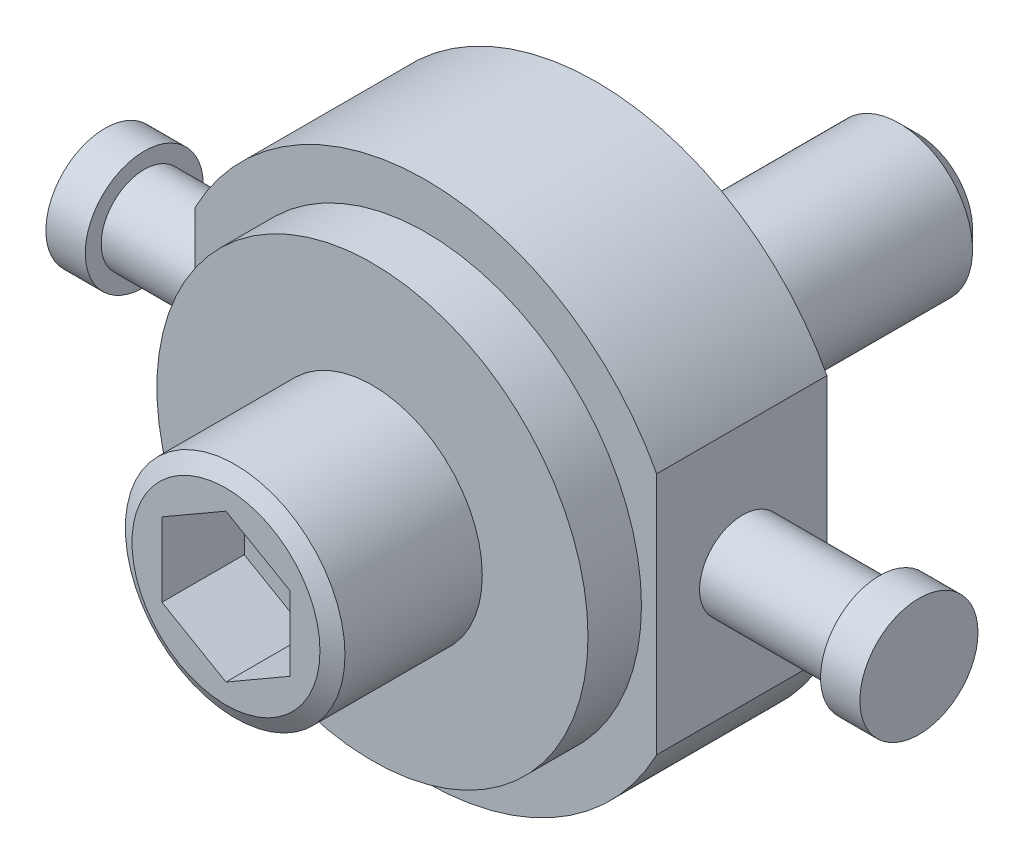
ISO-10303-21;
HEADER;
FILE_DESCRIPTION(('STEP AP214'),'2;1');
FILE_NAME('part.step','',(''),(''),'','','');
FILE_SCHEMA(('AUTOMOTIVE_DESIGN { 1 0 10303 214 1 1 1 1 }'));
ENDSEC;
DATA;
#1=APPLICATION_CONTEXT('core data for automotive mechanical design processes');
#2=APPLICATION_PROTOCOL_DEFINITION('international standard','automotive_design',2000,#1);
#3=PRODUCT_CONTEXT('',#1,'mechanical');
#4=PRODUCT('Part','Part','',(#3));
#5=PRODUCT_RELATED_PRODUCT_CATEGORY('part','',(#4));
#6=PRODUCT_DEFINITION_FORMATION('','',#4);
#7=PRODUCT_DEFINITION_CONTEXT('part definition',#1,'design');
#8=PRODUCT_DEFINITION('design','',#6,#7);
#9=PRODUCT_DEFINITION_SHAPE('','',#8);
#10=(LENGTH_UNIT() NAMED_UNIT(*) SI_UNIT(.MILLI.,.METRE.));
#11=(NAMED_UNIT(*) PLANE_ANGLE_UNIT() SI_UNIT($,.RADIAN.));
#12=(NAMED_UNIT(*) SI_UNIT($,.STERADIAN.) SOLID_ANGLE_UNIT());
#13=UNCERTAINTY_MEASURE_WITH_UNIT(LENGTH_MEASURE(1.E-05),#10,'distance_accuracy_value','');
#14=(GEOMETRIC_REPRESENTATION_CONTEXT(3) GLOBAL_UNCERTAINTY_ASSIGNED_CONTEXT((#13)) GLOBAL_UNIT_ASSIGNED_CONTEXT((#10,
#11,#12)) REPRESENTATION_CONTEXT('',''));
#15=CARTESIAN_POINT('',(0.,0.,0.));
#16=DIRECTION('',(0.,0.,1.));
#17=DIRECTION('',(1.,0.,0.));
#18=AXIS2_PLACEMENT_3D('',#15,#16,#17);
#19=CARTESIAN_POINT('',(0.,0.,0.));
#20=DIRECTION('',(0.,0.,1.));
#21=DIRECTION('',(1.,0.,0.));
#22=AXIS2_PLACEMENT_3D('',#19,#20,#21);
#23=PLANE('',#22);
#24=CARTESIAN_POINT('',(0.,0.,0.));
#25=DIRECTION('',(0.,0.,1.));
#26=DIRECTION('',(1.,0.,0.));
#27=AXIS2_PLACEMENT_3D('',#24,#25,#26);
#28=CIRCLE('',#27,18.9);
#29=CARTESIAN_POINT('',(18.9,0.,0.));
#30=VERTEX_POINT('',#29);
#31=EDGE_CURVE('E208',#30,#30,#28,.T.);
#32=ORIENTED_EDGE('',*,*,#31,.F.);
#33=EDGE_LOOP('',(#32));
#34=FACE_BOUND('',#33,.T.);
#35=CARTESIAN_POINT('',(0.,0.,0.));
#36=DIRECTION('',(0.,0.,-1.));
#37=DIRECTION('',(-1.,0.,0.));
#38=AXIS2_PLACEMENT_3D('',#35,#36,#37);
#39=CIRCLE('',#38,8.);
#40=CARTESIAN_POINT('',(-8.,0.,0.));
#41=VERTEX_POINT('',#40);
#42=EDGE_CURVE('E147',#41,#41,#39,.T.);
#43=ORIENTED_EDGE('',*,*,#42,.F.);
#44=EDGE_LOOP('',(#43));
#45=FACE_BOUND('',#44,.T.);
#46=ADVANCED_FACE('F14',(#34,#45),#23,.F.);
#47=CARTESIAN_POINT('',(40.165,0.,15.32));
#48=DIRECTION('',(1.,0.,0.));
#49=DIRECTION('',(0.,0.,-1.));
#50=AXIS2_PLACEMENT_3D('',#47,#48,#49);
#51=PLANE('',#50);
#52=CARTESIAN_POINT('',(40.165,0.,15.32));
#53=DIRECTION('',(1.,0.,0.));
#54=DIRECTION('',(0.,0.,-1.));
#55=AXIS2_PLACEMENT_3D('',#52,#53,#54);
#56=CIRCLE('',#55,4.71);
#57=CARTESIAN_POINT('',(40.165,0.,10.61));
#58=VERTEX_POINT('',#57);
#59=EDGE_CURVE('E151',#58,#58,#56,.T.);
#60=ORIENTED_EDGE('',*,*,#59,.T.);
#61=EDGE_LOOP('',(#60));
#62=FACE_BOUND('',#61,.T.);
#63=CARTESIAN_POINT('',(40.165,0.,15.32));
#64=DIRECTION('',(1.,0.,0.));
#65=DIRECTION('',(0.,0.,-1.));
#66=AXIS2_PLACEMENT_3D('',#63,#64,#65);
#67=CIRCLE('',#66,6.45);
#68=CARTESIAN_POINT('',(40.165,0.,8.87));
#69=VERTEX_POINT('',#68);
#70=EDGE_CURVE('E157',#69,#69,#67,.T.);
#71=ORIENTED_EDGE('',*,*,#70,.F.);
#72=EDGE_LOOP('',(#71));
#73=FACE_BOUND('',#72,.T.);
#74=ADVANCED_FACE('F238',(#62,#73),#51,.F.);
#75=CARTESIAN_POINT('',(-40.165,0.,15.32));
#76=DIRECTION('',(1.,0.,0.));
#77=DIRECTION('',(0.,0.,-1.));
#78=AXIS2_PLACEMENT_3D('',#75,#76,#77);
#79=PLANE('',#78);
#80=CARTESIAN_POINT('',(-40.165,0.,15.32));
#81=DIRECTION('',(1.,0.,0.));
#82=DIRECTION('',(0.,0.,-1.));
#83=AXIS2_PLACEMENT_3D('',#80,#81,#82);
#84=CIRCLE('',#83,4.71);
#85=CARTESIAN_POINT('',(-40.165,0.,10.61));
#86=VERTEX_POINT('',#85);
#87=EDGE_CURVE('E214',#86,#86,#84,.F.);
#88=ORIENTED_EDGE('',*,*,#87,.T.);
#89=EDGE_LOOP('',(#88));
#90=FACE_BOUND('',#89,.T.);
#91=CARTESIAN_POINT('',(-40.165,0.,15.32));
#92=DIRECTION('',(1.,0.,0.));
#93=DIRECTION('',(0.,0.,-1.));
#94=AXIS2_PLACEMENT_3D('',#91,#92,#93);
#95=CIRCLE('',#94,6.45);
#96=CARTESIAN_POINT('',(-40.165,0.,8.87));
#97=VERTEX_POINT('',#96);
#98=EDGE_CURVE('E139',#97,#97,#95,.T.);
#99=ORIENTED_EDGE('',*,*,#98,.T.);
#100=EDGE_LOOP('',(#99));
#101=FACE_BOUND('',#100,.T.);
#102=ADVANCED_FACE('F244',(#90,#101),#79,.T.);
#103=CARTESIAN_POINT('',(41.21,0.,15.32));
#104=DIRECTION('',(-1.,0.,0.));
#105=DIRECTION('',(0.,0.,1.));
#106=AXIS2_PLACEMENT_3D('',#103,#104,#105);
#107=CYLINDRICAL_SURFACE('',#106,4.71);
#108=CARTESIAN_POINT('',(25.21,0.,15.32));
#109=DIRECTION('',(1.,0.,0.));
#110=DIRECTION('',(0.,0.,-1.));
#111=AXIS2_PLACEMENT_3D('',#108,#109,#110);
#112=CIRCLE('',#111,4.71);
#113=CARTESIAN_POINT('',(25.21,0.,10.61));
#114=VERTEX_POINT('',#113);
#115=EDGE_CURVE('E166',#114,#114,#112,.T.);
#116=ORIENTED_EDGE('',*,*,#115,.T.);
#117=EDGE_LOOP('',(#116));
#118=FACE_BOUND('',#117,.T.);
#119=ORIENTED_EDGE('',*,*,#59,.F.);
#120=EDGE_LOOP('',(#119));
#121=FACE_BOUND('',#120,.T.);
#122=ADVANCED_FACE('F295',(#118,#121),#107,.T.);
#123=CARTESIAN_POINT('',(25.21,13.2930771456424,24.72));
#124=DIRECTION('',(1.,0.,0.));
#125=DIRECTION('',(0.,0.,-1.));
#126=AXIS2_PLACEMENT_3D('',#123,#124,#125);
#127=PLANE('',#126);
#128=DIRECTION('',(0.,0.,-1.));
#129=VECTOR('',#128,1.);
#130=CARTESIAN_POINT('',(25.21,13.2930771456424,24.72));
#131=LINE('',#130,#129);
#132=CARTESIAN_POINT('',(25.21,13.2930771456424,24.72));
#133=VERTEX_POINT('',#132);
#134=CARTESIAN_POINT('',(25.21,13.2930771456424,6.12));
#135=VERTEX_POINT('',#134);
#136=EDGE_CURVE('E204',#133,#135,#131,.T.);
#137=ORIENTED_EDGE('',*,*,#136,.F.);
#138=DIRECTION('',(0.,-1.,0.));
#139=VECTOR('',#138,1.);
#140=CARTESIAN_POINT('',(25.21,13.2930771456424,24.72));
#141=LINE('',#140,#139);
#142=CARTESIAN_POINT('',(25.21,-13.2930771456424,24.72));
#143=VERTEX_POINT('',#142);
#144=EDGE_CURVE('E196',#133,#143,#141,.T.);
#145=ORIENTED_EDGE('',*,*,#144,.T.);
#146=DIRECTION('',(0.,0.,-1.));
#147=VECTOR('',#146,1.);
#148=CARTESIAN_POINT('',(25.21,-13.2930771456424,24.72));
#149=LINE('',#148,#147);
#150=CARTESIAN_POINT('',(25.21,-13.2930771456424,6.12));
#151=VERTEX_POINT('',#150);
#152=EDGE_CURVE('E206',#143,#151,#149,.T.);
#153=ORIENTED_EDGE('',*,*,#152,.T.);
#154=DIRECTION('',(0.,-1.,0.));
#155=VECTOR('',#154,1.);
#156=CARTESIAN_POINT('',(25.21,13.2930771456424,6.12));
#157=LINE('',#156,#155);
#158=EDGE_CURVE('E185',#135,#151,#157,.T.);
#159=ORIENTED_EDGE('',*,*,#158,.F.);
#160=EDGE_LOOP('',(#137,#145,#153,#159));
#161=FACE_BOUND('',#160,.T.);
#162=ORIENTED_EDGE('',*,*,#115,.F.);
#163=EDGE_LOOP('',(#162));
#164=FACE_BOUND('',#163,.T.);
#165=ADVANCED_FACE('F251',(#161,#164),#127,.T.);
#166=CARTESIAN_POINT('',(0.,0.,30.56));
#167=DIRECTION('',(0.,0.,1.));
#168=DIRECTION('',(1.,0.,0.));
#169=AXIS2_PLACEMENT_3D('',#166,#167,#168);
#170=PLANE('',#169);
#171=CARTESIAN_POINT('',(0.,0.,30.56));
#172=DIRECTION('',(0.,0.,1.));
#173=DIRECTION('',(1.,0.,0.));
#174=AXIS2_PLACEMENT_3D('',#171,#172,#173);
#175=CIRCLE('',#174,23.55);
#176=CARTESIAN_POINT('',(23.55,0.,30.56));
#177=VERTEX_POINT('',#176);
#178=EDGE_CURVE('E175',#177,#177,#175,.T.);
#179=ORIENTED_EDGE('',*,*,#178,.T.);
#180=EDGE_LOOP('',(#179));
#181=FACE_BOUND('',#180,.T.);
#182=CARTESIAN_POINT('',(0.,0.,30.56));
#183=DIRECTION('',(0.,0.,1.));
#184=DIRECTION('',(1.,0.,0.));
#185=AXIS2_PLACEMENT_3D('',#182,#183,#184);
#186=CIRCLE('',#185,12.);
#187=CARTESIAN_POINT('',(12.,0.,30.56));
#188=VERTEX_POINT('',#187);
#189=EDGE_CURVE('E169',#188,#188,#186,.T.);
#190=ORIENTED_EDGE('',*,*,#189,.F.);
#191=EDGE_LOOP('',(#190));
#192=FACE_BOUND('',#191,.T.);
#193=ADVANCED_FACE('F283',(#181,#192),#170,.T.);
#194=CARTESIAN_POINT('',(0.,0.,24.72));
#195=DIRECTION('',(0.,0.,1.));
#196=DIRECTION('',(1.,0.,0.));
#197=AXIS2_PLACEMENT_3D('',#194,#195,#196);
#198=PLANE('',#197);
#199=CARTESIAN_POINT('',(0.,0.,24.72));
#200=DIRECTION('',(0.,0.,1.));
#201=DIRECTION('',(1.,0.,0.));
#202=AXIS2_PLACEMENT_3D('',#199,#200,#201);
#203=CIRCLE('',#202,28.5);
#204=CARTESIAN_POINT('',(-25.21,-13.2930771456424,24.72));
#205=VERTEX_POINT('',#204);
#206=EDGE_CURVE('E181',#205,#143,#203,.T.);
#207=ORIENTED_EDGE('',*,*,#206,.T.);
#208=ORIENTED_EDGE('',*,*,#144,.F.);
#209=CARTESIAN_POINT('',(0.,0.,24.72));
#210=DIRECTION('',(0.,0.,1.));
#211=DIRECTION('',(1.,0.,0.));
#212=AXIS2_PLACEMENT_3D('',#209,#210,#211);
#213=CIRCLE('',#212,28.5);
#214=CARTESIAN_POINT('',(-25.21,13.2930771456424,24.72));
#215=VERTEX_POINT('',#214);
#216=EDGE_CURVE('E193',#133,#215,#213,.T.);
#217=ORIENTED_EDGE('',*,*,#216,.T.);
#218=DIRECTION('',(0.,-1.,0.));
#219=VECTOR('',#218,1.);
#220=CARTESIAN_POINT('',(-25.21,13.2930771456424,24.72));
#221=LINE('',#220,#219);
#222=EDGE_CURVE('E190',#215,#205,#221,.T.);
#223=ORIENTED_EDGE('',*,*,#222,.T.);
#224=EDGE_LOOP('',(#207,#208,#217,#223));
#225=FACE_BOUND('',#224,.T.);
#226=CARTESIAN_POINT('',(0.,0.,24.72));
#227=DIRECTION('',(0.,0.,1.));
#228=DIRECTION('',(1.,0.,0.));
#229=AXIS2_PLACEMENT_3D('',#226,#227,#228);
#230=CIRCLE('',#229,23.55);
#231=CARTESIAN_POINT('',(23.55,0.,24.72));
#232=VERTEX_POINT('',#231);
#233=EDGE_CURVE('E172',#232,#232,#230,.T.);
#234=ORIENTED_EDGE('',*,*,#233,.F.);
#235=EDGE_LOOP('',(#234));
#236=FACE_BOUND('',#235,.T.);
#237=ADVANCED_FACE('F285',(#225,#236),#198,.T.);
#238=CARTESIAN_POINT('',(0.,0.,6.12));
#239=DIRECTION('',(0.,0.,1.));
#240=DIRECTION('',(1.,0.,0.));
#241=AXIS2_PLACEMENT_3D('',#238,#239,#240);
#242=PLANE('',#241);
#243=CARTESIAN_POINT('',(0.,0.,6.12));
#244=DIRECTION('',(0.,0.,1.));
#245=DIRECTION('',(1.,0.,0.));
#246=AXIS2_PLACEMENT_3D('',#243,#244,#245);
#247=CIRCLE('',#246,28.5);
#248=CARTESIAN_POINT('',(-25.21,-13.2930771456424,6.12));
#249=VERTEX_POINT('',#248);
#250=EDGE_CURVE('E178',#249,#151,#247,.T.);
#251=ORIENTED_EDGE('',*,*,#250,.F.);
#252=DIRECTION('',(0.,-1.,0.));
#253=VECTOR('',#252,1.);
#254=CARTESIAN_POINT('',(-25.21,13.2930771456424,6.12));
#255=LINE('',#254,#253);
#256=CARTESIAN_POINT('',(-25.21,13.2930771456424,6.12));
#257=VERTEX_POINT('',#256);
#258=EDGE_CURVE('E179',#257,#249,#255,.T.);
#259=ORIENTED_EDGE('',*,*,#258,.F.);
#260=CARTESIAN_POINT('',(0.,0.,6.12));
#261=DIRECTION('',(0.,0.,1.));
#262=DIRECTION('',(1.,0.,0.));
#263=AXIS2_PLACEMENT_3D('',#260,#261,#262);
#264=CIRCLE('',#263,28.5);
#265=EDGE_CURVE('E182',#135,#257,#264,.T.);
#266=ORIENTED_EDGE('',*,*,#265,.F.);
#267=ORIENTED_EDGE('',*,*,#158,.T.);
#268=EDGE_LOOP('',(#251,#259,#266,#267));
#269=FACE_BOUND('',#268,.T.);
#270=CARTESIAN_POINT('',(0.,0.,6.12));
#271=DIRECTION('',(0.,0.,1.));
#272=DIRECTION('',(1.,0.,0.));
#273=AXIS2_PLACEMENT_3D('',#270,#271,#272);
#274=CIRCLE('',#273,18.9);
#275=CARTESIAN_POINT('',(18.9,0.,6.12));
#276=VERTEX_POINT('',#275);
#277=EDGE_CURVE('E211',#276,#276,#274,.T.);
#278=ORIENTED_EDGE('',*,*,#277,.T.);
#279=EDGE_LOOP('',(#278));
#280=FACE_BOUND('',#279,.T.);
#281=ADVANCED_FACE('F292',(#269,#280),#242,.F.);
#282=CARTESIAN_POINT('',(0.,0.,24.72));
#283=DIRECTION('',(0.,0.,-1.));
#284=DIRECTION('',(-1.,0.,0.));
#285=AXIS2_PLACEMENT_3D('',#282,#283,#284);
#286=CYLINDRICAL_SURFACE('',#285,28.5);
#287=ORIENTED_EDGE('',*,*,#152,.F.);
#288=ORIENTED_EDGE('',*,*,#206,.F.);
#289=DIRECTION('',(0.,0.,-1.));
#290=VECTOR('',#289,1.);
#291=CARTESIAN_POINT('',(-25.21,-13.2930771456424,24.72));
#292=LINE('',#291,#290);
#293=EDGE_CURVE('E37',#205,#249,#292,.T.);
#294=ORIENTED_EDGE('',*,*,#293,.T.);
#295=ORIENTED_EDGE('',*,*,#250,.T.);
#296=EDGE_LOOP('',(#287,#288,#294,#295));
#297=FACE_BOUND('',#296,.T.);
#298=ADVANCED_FACE('F302',(#297),#286,.T.);
#299=CARTESIAN_POINT('',(0.,0.,24.72));
#300=DIRECTION('',(0.,0.,-1.));
#301=DIRECTION('',(-1.,0.,0.));
#302=AXIS2_PLACEMENT_3D('',#299,#300,#301);
#303=CYLINDRICAL_SURFACE('',#302,28.5);
#304=DIRECTION('',(0.,0.,-1.));
#305=VECTOR('',#304,1.);
#306=CARTESIAN_POINT('',(-25.21,13.2930771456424,24.72));
#307=LINE('',#306,#305);
#308=EDGE_CURVE('E202',#215,#257,#307,.T.);
#309=ORIENTED_EDGE('',*,*,#308,.F.);
#310=ORIENTED_EDGE('',*,*,#216,.F.);
#311=ORIENTED_EDGE('',*,*,#136,.T.);
#312=ORIENTED_EDGE('',*,*,#265,.T.);
#313=EDGE_LOOP('',(#309,#310,#311,#312));
#314=FACE_BOUND('',#313,.T.);
#315=ADVANCED_FACE('F307',(#314),#303,.T.);
#316=CARTESIAN_POINT('',(-25.21,13.2930771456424,24.72));
#317=DIRECTION('',(1.,0.,0.));
#318=DIRECTION('',(0.,0.,-1.));
#319=AXIS2_PLACEMENT_3D('',#316,#317,#318);
#320=PLANE('',#319);
#321=CARTESIAN_POINT('',(-25.21,0.,15.32));
#322=DIRECTION('',(1.,0.,0.));
#323=DIRECTION('',(0.,0.,-1.));
#324=AXIS2_PLACEMENT_3D('',#321,#322,#323);
#325=CIRCLE('',#324,4.71);
#326=CARTESIAN_POINT('',(-25.21,0.,10.61));
#327=VERTEX_POINT('',#326);
#328=EDGE_CURVE('E163',#327,#327,#325,.T.);
#329=ORIENTED_EDGE('',*,*,#328,.T.);
#330=EDGE_LOOP('',(#329));
#331=FACE_BOUND('',#330,.T.);
#332=ORIENTED_EDGE('',*,*,#222,.F.);
#333=ORIENTED_EDGE('',*,*,#308,.T.);
#334=ORIENTED_EDGE('',*,*,#258,.T.);
#335=ORIENTED_EDGE('',*,*,#293,.F.);
#336=EDGE_LOOP('',(#332,#333,#334,#335));
#337=FACE_BOUND('',#336,.T.);
#338=ADVANCED_FACE('F256',(#331,#337),#320,.F.);
#339=CARTESIAN_POINT('',(0.,0.,6.12));
#340=DIRECTION('',(0.,0.,-1.));
#341=DIRECTION('',(-1.,0.,0.));
#342=AXIS2_PLACEMENT_3D('',#339,#340,#341);
#343=CYLINDRICAL_SURFACE('',#342,18.9);
#344=ORIENTED_EDGE('',*,*,#277,.F.);
#345=EDGE_LOOP('',(#344));
#346=FACE_BOUND('',#345,.T.);
#347=ORIENTED_EDGE('',*,*,#31,.T.);
#348=EDGE_LOOP('',(#347));
#349=FACE_BOUND('',#348,.T.);
#350=ADVANCED_FACE('F253',(#346,#349),#343,.T.);
#351=CARTESIAN_POINT('',(0.,0.,30.56));
#352=DIRECTION('',(0.,0.,-1.));
#353=DIRECTION('',(-1.,0.,0.));
#354=AXIS2_PLACEMENT_3D('',#351,#352,#353);
#355=CYLINDRICAL_SURFACE('',#354,23.55);
#356=ORIENTED_EDGE('',*,*,#178,.F.);
#357=EDGE_LOOP('',(#356));
#358=FACE_BOUND('',#357,.T.);
#359=ORIENTED_EDGE('',*,*,#233,.T.);
#360=EDGE_LOOP('',(#359));
#361=FACE_BOUND('',#360,.T.);
#362=ADVANCED_FACE('F255',(#358,#361),#355,.T.);
#363=CARTESIAN_POINT('',(0.,0.,46.56));
#364=DIRECTION('',(0.,0.,-1.));
#365=DIRECTION('',(-1.,0.,0.));
#366=AXIS2_PLACEMENT_3D('',#363,#364,#365);
#367=CYLINDRICAL_SURFACE('',#366,12.);
#368=CARTESIAN_POINT('',(0.,0.,45.56));
#369=DIRECTION('',(0.,0.,1.));
#370=DIRECTION('',(1.,0.,0.));
#371=AXIS2_PLACEMENT_3D('',#368,#369,#370);
#372=CIRCLE('',#371,12.);
#373=CARTESIAN_POINT('',(12.,0.,45.56));
#374=VERTEX_POINT('',#373);
#375=EDGE_CURVE('E150',#374,#374,#372,.F.);
#376=ORIENTED_EDGE('',*,*,#375,.T.);
#377=EDGE_LOOP('',(#376));
#378=FACE_BOUND('',#377,.T.);
#379=ORIENTED_EDGE('',*,*,#189,.T.);
#380=EDGE_LOOP('',(#379));
#381=FACE_BOUND('',#380,.T.);
#382=ADVANCED_FACE('F276',(#378,#381),#367,.T.);
#383=CARTESIAN_POINT('',(-41.21,0.,15.32));
#384=DIRECTION('',(1.,0.,0.));
#385=DIRECTION('',(0.,0.,-1.));
#386=AXIS2_PLACEMENT_3D('',#383,#384,#385);
#387=CYLINDRICAL_SURFACE('',#386,4.71);
#388=ORIENTED_EDGE('',*,*,#87,.F.);
#389=EDGE_LOOP('',(#388));
#390=FACE_BOUND('',#389,.T.);
#391=ORIENTED_EDGE('',*,*,#328,.F.);
#392=EDGE_LOOP('',(#391));
#393=FACE_BOUND('',#392,.T.);
#394=ADVANCED_FACE('F279',(#390,#393),#387,.T.);
#395=CARTESIAN_POINT('',(0.,0.,-28.));
#396=DIRECTION('',(0.,0.,1.));
#397=DIRECTION('',(1.,0.,0.));
#398=AXIS2_PLACEMENT_3D('',#395,#396,#397);
#399=CYLINDRICAL_SURFACE('',#398,8.);
#400=CARTESIAN_POINT('',(0.,0.,-27.));
#401=DIRECTION('',(0.,0.,-1.));
#402=DIRECTION('',(-1.,0.,0.));
#403=AXIS2_PLACEMENT_3D('',#400,#401,#402);
#404=CIRCLE('',#403,8.);
#405=CARTESIAN_POINT('',(-8.,0.,-27.));
#406=VERTEX_POINT('',#405);
#407=EDGE_CURVE('E9',#406,#406,#404,.F.);
#408=ORIENTED_EDGE('',*,*,#407,.T.);
#409=EDGE_LOOP('',(#408));
#410=FACE_BOUND('',#409,.T.);
#411=ORIENTED_EDGE('',*,*,#42,.T.);
#412=EDGE_LOOP('',(#411));
#413=FACE_BOUND('',#412,.T.);
#414=ADVANCED_FACE('F347',(#410,#413),#399,.T.);
#415=CARTESIAN_POINT('',(0.,8.08290376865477,37.56));
#416=DIRECTION('',(0.,0.,1.));
#417=DIRECTION('',(1.,0.,0.));
#418=AXIS2_PLACEMENT_3D('',#415,#416,#417);
#419=PLANE('',#418);
#420=DIRECTION('',(-0.866025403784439,0.5,0.));
#421=VECTOR('',#420,1.);
#422=CARTESIAN_POINT('',(7.,4.04145188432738,37.56));
#423=LINE('',#422,#421);
#424=CARTESIAN_POINT('',(7.,4.04145188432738,37.56));
#425=VERTEX_POINT('',#424);
#426=CARTESIAN_POINT('',(0.,8.08290376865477,37.56));
#427=VERTEX_POINT('',#426);
#428=EDGE_CURVE('E94',#425,#427,#423,.T.);
#429=ORIENTED_EDGE('',*,*,#428,.T.);
#430=DIRECTION('',(-0.866025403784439,-0.5,0.));
#431=VECTOR('',#430,1.);
#432=CARTESIAN_POINT('',(0.,8.08290376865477,37.56));
#433=LINE('',#432,#431);
#434=CARTESIAN_POINT('',(-7.,4.04145188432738,37.56));
#435=VERTEX_POINT('',#434);
#436=EDGE_CURVE('E103',#427,#435,#433,.T.);
#437=ORIENTED_EDGE('',*,*,#436,.T.);
#438=DIRECTION('',(0.,-1.,0.));
#439=VECTOR('',#438,1.);
#440=CARTESIAN_POINT('',(-7.,4.04145188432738,37.56));
#441=LINE('',#440,#439);
#442=CARTESIAN_POINT('',(-7.,-4.04145188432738,37.56));
#443=VERTEX_POINT('',#442);
#444=EDGE_CURVE('E108',#435,#443,#441,.T.);
#445=ORIENTED_EDGE('',*,*,#444,.T.);
#446=DIRECTION('',(0.866025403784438,-0.5,0.));
#447=VECTOR('',#446,1.);
#448=CARTESIAN_POINT('',(-7.,-4.04145188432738,37.56));
#449=LINE('',#448,#447);
#450=CARTESIAN_POINT('',(0.,-8.08290376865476,37.56));
#451=VERTEX_POINT('',#450);
#452=EDGE_CURVE('E120',#443,#451,#449,.T.);
#453=ORIENTED_EDGE('',*,*,#452,.T.);
#454=DIRECTION('',(0.866025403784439,0.5,0.));
#455=VECTOR('',#454,1.);
#456=CARTESIAN_POINT('',(0.,-8.08290376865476,37.56));
#457=LINE('',#456,#455);
#458=CARTESIAN_POINT('',(7.,-4.04145188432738,37.56));
#459=VERTEX_POINT('',#458);
#460=EDGE_CURVE('E123',#451,#459,#457,.T.);
#461=ORIENTED_EDGE('',*,*,#460,.T.);
#462=DIRECTION('',(0.,1.,0.));
#463=VECTOR('',#462,1.);
#464=CARTESIAN_POINT('',(7.,-4.04145188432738,37.56));
#465=LINE('',#464,#463);
#466=EDGE_CURVE('E100',#459,#425,#465,.T.);
#467=ORIENTED_EDGE('',*,*,#466,.T.);
#468=EDGE_LOOP('',(#429,#437,#445,#453,#461,#467));
#469=FACE_BOUND('',#468,.T.);
#470=ADVANCED_FACE('F110',(#469),#419,.T.);
#471=CARTESIAN_POINT('',(0.,8.08290376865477,37.56));
#472=DIRECTION('',(-0.5,0.866025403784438,0.));
#473=DIRECTION('',(-0.866025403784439,-0.5,0.));
#474=AXIS2_PLACEMENT_3D('',#471,#472,#473);
#475=PLANE('',#474);
#476=DIRECTION('',(-0.866025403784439,-0.5,0.));
#477=VECTOR('',#476,1.);
#478=CARTESIAN_POINT('',(0.,8.08290376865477,46.56));
#479=LINE('',#478,#477);
#480=CARTESIAN_POINT('',(0.,8.08290376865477,46.56));
#481=VERTEX_POINT('',#480);
#482=CARTESIAN_POINT('',(-7.,4.04145188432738,46.56));
#483=VERTEX_POINT('',#482);
#484=EDGE_CURVE('E127',#481,#483,#479,.T.);
#485=ORIENTED_EDGE('',*,*,#484,.T.);
#486=DIRECTION('',(0.,0.,1.));
#487=VECTOR('',#486,1.);
#488=CARTESIAN_POINT('',(-7.,4.04145188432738,37.56));
#489=LINE('',#488,#487);
#490=EDGE_CURVE('E99',#435,#483,#489,.T.);
#491=ORIENTED_EDGE('',*,*,#490,.F.);
#492=ORIENTED_EDGE('',*,*,#436,.F.);
#493=DIRECTION('',(0.,0.,1.));
#494=VECTOR('',#493,1.);
#495=CARTESIAN_POINT('',(0.,8.08290376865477,37.56));
#496=LINE('',#495,#494);
#497=EDGE_CURVE('E90',#427,#481,#496,.T.);
#498=ORIENTED_EDGE('',*,*,#497,.T.);
#499=EDGE_LOOP('',(#485,#491,#492,#498));
#500=FACE_BOUND('',#499,.T.);
#501=ADVANCED_FACE('F104',(#500),#475,.F.);
#502=CARTESIAN_POINT('',(-7.,4.04145188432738,37.56));
#503=DIRECTION('',(-1.,0.,0.));
#504=DIRECTION('',(0.,-1.,0.));
#505=AXIS2_PLACEMENT_3D('',#502,#503,#504);
#506=PLANE('',#505);
#507=DIRECTION('',(0.,-1.,0.));
#508=VECTOR('',#507,1.);
#509=CARTESIAN_POINT('',(-7.,4.04145188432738,46.56));
#510=LINE('',#509,#508);
#511=CARTESIAN_POINT('',(-7.,-4.04145188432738,46.56));
#512=VERTEX_POINT('',#511);
#513=EDGE_CURVE('E129',#483,#512,#510,.T.);
#514=ORIENTED_EDGE('',*,*,#513,.T.);
#515=DIRECTION('',(0.,0.,1.));
#516=VECTOR('',#515,1.);
#517=CARTESIAN_POINT('',(-7.,-4.04145188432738,37.56));
#518=LINE('',#517,#516);
#519=EDGE_CURVE('E144',#443,#512,#518,.T.);
#520=ORIENTED_EDGE('',*,*,#519,.F.);
#521=ORIENTED_EDGE('',*,*,#444,.F.);
#522=ORIENTED_EDGE('',*,*,#490,.T.);
#523=EDGE_LOOP('',(#514,#520,#521,#522));
#524=FACE_BOUND('',#523,.T.);
#525=ADVANCED_FACE('F374',(#524),#506,.F.);
#526=CARTESIAN_POINT('',(-7.,-4.04145188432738,37.56));
#527=DIRECTION('',(-0.5,-0.866025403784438,0.));
#528=DIRECTION('',(0.866025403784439,-0.5,0.));
#529=AXIS2_PLACEMENT_3D('',#526,#527,#528);
#530=PLANE('',#529);
#531=DIRECTION('',(0.866025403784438,-0.5,0.));
#532=VECTOR('',#531,1.);
#533=CARTESIAN_POINT('',(-7.,-4.04145188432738,46.56));
#534=LINE('',#533,#532);
#535=CARTESIAN_POINT('',(0.,-8.08290376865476,46.56));
#536=VERTEX_POINT('',#535);
#537=EDGE_CURVE('E132',#512,#536,#534,.T.);
#538=ORIENTED_EDGE('',*,*,#537,.T.);
#539=DIRECTION('',(0.,0.,1.));
#540=VECTOR('',#539,1.);
#541=CARTESIAN_POINT('',(0.,-8.08290376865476,37.56));
#542=LINE('',#541,#540);
#543=EDGE_CURVE('E142',#451,#536,#542,.T.);
#544=ORIENTED_EDGE('',*,*,#543,.F.);
#545=ORIENTED_EDGE('',*,*,#452,.F.);
#546=ORIENTED_EDGE('',*,*,#519,.T.);
#547=EDGE_LOOP('',(#538,#544,#545,#546));
#548=FACE_BOUND('',#547,.T.);
#549=ADVANCED_FACE('F377',(#548),#530,.F.);
#550=CARTESIAN_POINT('',(0.,-8.08290376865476,37.56));
#551=DIRECTION('',(0.5,-0.866025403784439,0.));
#552=DIRECTION('',(0.866025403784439,0.5,0.));
#553=AXIS2_PLACEMENT_3D('',#550,#551,#552);
#554=PLANE('',#553);
#555=DIRECTION('',(0.866025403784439,0.5,0.));
#556=VECTOR('',#555,1.);
#557=CARTESIAN_POINT('',(0.,-8.08290376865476,46.56));
#558=LINE('',#557,#556);
#559=CARTESIAN_POINT('',(7.,-4.04145188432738,46.56));
#560=VERTEX_POINT('',#559);
#561=EDGE_CURVE('E116',#536,#560,#558,.T.);
#562=ORIENTED_EDGE('',*,*,#561,.T.);
#563=DIRECTION('',(0.,0.,1.));
#564=VECTOR('',#563,1.);
#565=CARTESIAN_POINT('',(7.,-4.04145188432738,37.56));
#566=LINE('',#565,#564);
#567=EDGE_CURVE('E140',#459,#560,#566,.T.);
#568=ORIENTED_EDGE('',*,*,#567,.F.);
#569=ORIENTED_EDGE('',*,*,#460,.F.);
#570=ORIENTED_EDGE('',*,*,#543,.T.);
#571=EDGE_LOOP('',(#562,#568,#569,#570));
#572=FACE_BOUND('',#571,.T.);
#573=ADVANCED_FACE('F381',(#572),#554,.F.);
#574=CARTESIAN_POINT('',(7.,-4.04145188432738,37.56));
#575=DIRECTION('',(1.,0.,0.));
#576=DIRECTION('',(0.,0.,-1.));
#577=AXIS2_PLACEMENT_3D('',#574,#575,#576);
#578=PLANE('',#577);
#579=DIRECTION('',(0.,1.,0.));
#580=VECTOR('',#579,1.);
#581=CARTESIAN_POINT('',(7.,-4.04145188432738,46.56));
#582=LINE('',#581,#580);
#583=CARTESIAN_POINT('',(7.,4.04145188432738,46.56));
#584=VERTEX_POINT('',#583);
#585=EDGE_CURVE('E113',#560,#584,#582,.T.);
#586=ORIENTED_EDGE('',*,*,#585,.T.);
#587=DIRECTION('',(0.,0.,1.));
#588=VECTOR('',#587,1.);
#589=CARTESIAN_POINT('',(7.,4.04145188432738,37.56));
#590=LINE('',#589,#588);
#591=EDGE_CURVE('E137',#425,#584,#590,.T.);
#592=ORIENTED_EDGE('',*,*,#591,.F.);
#593=ORIENTED_EDGE('',*,*,#466,.F.);
#594=ORIENTED_EDGE('',*,*,#567,.T.);
#595=EDGE_LOOP('',(#586,#592,#593,#594));
#596=FACE_BOUND('',#595,.T.);
#597=ADVANCED_FACE('F371',(#596),#578,.F.);
#598=CARTESIAN_POINT('',(7.,4.04145188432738,37.56));
#599=DIRECTION('',(0.5,0.866025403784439,0.));
#600=DIRECTION('',(-0.866025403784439,0.5,0.));
#601=AXIS2_PLACEMENT_3D('',#598,#599,#600);
#602=PLANE('',#601);
#603=DIRECTION('',(-0.866025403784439,0.5,0.));
#604=VECTOR('',#603,1.);
#605=CARTESIAN_POINT('',(7.,4.04145188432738,46.56));
#606=LINE('',#605,#604);
#607=EDGE_CURVE('E29',#584,#481,#606,.T.);
#608=ORIENTED_EDGE('',*,*,#607,.T.);
#609=ORIENTED_EDGE('',*,*,#497,.F.);
#610=ORIENTED_EDGE('',*,*,#428,.F.);
#611=ORIENTED_EDGE('',*,*,#591,.T.);
#612=EDGE_LOOP('',(#608,#609,#610,#611));
#613=FACE_BOUND('',#612,.T.);
#614=ADVANCED_FACE('F92',(#613),#602,.F.);
#615=CARTESIAN_POINT('',(0.,0.,46.56));
#616=DIRECTION('',(0.,0.,1.));
#617=DIRECTION('',(1.,0.,0.));
#618=AXIS2_PLACEMENT_3D('',#615,#616,#617);
#619=PLANE('',#618);
#620=CARTESIAN_POINT('',(0.,0.,46.56));
#621=DIRECTION('',(0.,0.,1.));
#622=DIRECTION('',(1.,0.,0.));
#623=AXIS2_PLACEMENT_3D('',#620,#621,#622);
#624=CIRCLE('',#623,10.2679491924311);
#625=CARTESIAN_POINT('',(10.2679491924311,0.,46.56));
#626=VERTEX_POINT('',#625);
#627=EDGE_CURVE('E221',#626,#626,#624,.T.);
#628=ORIENTED_EDGE('',*,*,#627,.T.);
#629=EDGE_LOOP('',(#628));
#630=FACE_BOUND('',#629,.T.);
#631=ORIENTED_EDGE('',*,*,#607,.F.);
#632=ORIENTED_EDGE('',*,*,#585,.F.);
#633=ORIENTED_EDGE('',*,*,#561,.F.);
#634=ORIENTED_EDGE('',*,*,#537,.F.);
#635=ORIENTED_EDGE('',*,*,#513,.F.);
#636=ORIENTED_EDGE('',*,*,#484,.F.);
#637=EDGE_LOOP('',(#631,#632,#633,#634,#635,#636));
#638=FACE_BOUND('',#637,.T.);
#639=ADVANCED_FACE('F261',(#630,#638),#619,.T.);
#640=CARTESIAN_POINT('',(0.,0.,45.56));
#641=DIRECTION('',(0.,0.,-1.));
#642=DIRECTION('',(-1.,0.,0.));
#643=AXIS2_PLACEMENT_3D('',#640,#641,#642);
#644=CONICAL_SURFACE('',#643,12.,1.0471975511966);
#645=ORIENTED_EDGE('',*,*,#627,.F.);
#646=EDGE_LOOP('',(#645));
#647=FACE_BOUND('',#646,.T.);
#648=ORIENTED_EDGE('',*,*,#375,.F.);
#649=EDGE_LOOP('',(#648));
#650=FACE_BOUND('',#649,.T.);
#651=ADVANCED_FACE('F258',(#647,#650),#644,.T.);
#652=CARTESIAN_POINT('',(44.465,0.,15.32));
#653=DIRECTION('',(1.,0.,0.));
#654=DIRECTION('',(0.,0.,-1.));
#655=AXIS2_PLACEMENT_3D('',#652,#653,#654);
#656=PLANE('',#655);
#657=CARTESIAN_POINT('',(44.465,0.,15.32));
#658=DIRECTION('',(1.,0.,0.));
#659=DIRECTION('',(0.,0.,-1.));
#660=AXIS2_PLACEMENT_3D('',#657,#658,#659);
#661=CIRCLE('',#660,6.45);
#662=CARTESIAN_POINT('',(44.465,0.,8.87));
#663=VERTEX_POINT('',#662);
#664=EDGE_CURVE('E160',#663,#663,#661,.T.);
#665=ORIENTED_EDGE('',*,*,#664,.T.);
#666=EDGE_LOOP('',(#665));
#667=FACE_BOUND('',#666,.T.);
#668=ADVANCED_FACE('F260',(#667),#656,.T.);
#669=CARTESIAN_POINT('',(44.465,0.,15.32));
#670=DIRECTION('',(-1.,0.,0.));
#671=DIRECTION('',(0.,0.,1.));
#672=AXIS2_PLACEMENT_3D('',#669,#670,#671);
#673=CYLINDRICAL_SURFACE('',#672,6.45);
#674=ORIENTED_EDGE('',*,*,#664,.F.);
#675=EDGE_LOOP('',(#674));
#676=FACE_BOUND('',#675,.T.);
#677=ORIENTED_EDGE('',*,*,#70,.T.);
#678=EDGE_LOOP('',(#677));
#679=FACE_BOUND('',#678,.T.);
#680=ADVANCED_FACE('F267',(#676,#679),#673,.T.);
#681=CARTESIAN_POINT('',(-44.465,0.,15.32));
#682=DIRECTION('',(1.,0.,0.));
#683=DIRECTION('',(0.,0.,-1.));
#684=AXIS2_PLACEMENT_3D('',#681,#682,#683);
#685=PLANE('',#684);
#686=CARTESIAN_POINT('',(-44.465,0.,15.32));
#687=DIRECTION('',(1.,0.,0.));
#688=DIRECTION('',(0.,0.,-1.));
#689=AXIS2_PLACEMENT_3D('',#686,#687,#688);
#690=CIRCLE('',#689,6.45);
#691=CARTESIAN_POINT('',(-44.465,0.,8.87));
#692=VERTEX_POINT('',#691);
#693=EDGE_CURVE('E154',#692,#692,#690,.T.);
#694=ORIENTED_EDGE('',*,*,#693,.F.);
#695=EDGE_LOOP('',(#694));
#696=FACE_BOUND('',#695,.T.);
#697=ADVANCED_FACE('F336',(#696),#685,.F.);
#698=CARTESIAN_POINT('',(-44.465,0.,15.32));
#699=DIRECTION('',(1.,0.,0.));
#700=DIRECTION('',(0.,0.,-1.));
#701=AXIS2_PLACEMENT_3D('',#698,#699,#700);
#702=CYLINDRICAL_SURFACE('',#701,6.45);
#703=ORIENTED_EDGE('',*,*,#693,.T.);
#704=EDGE_LOOP('',(#703));
#705=FACE_BOUND('',#704,.T.);
#706=ORIENTED_EDGE('',*,*,#98,.F.);
#707=EDGE_LOOP('',(#706));
#708=FACE_BOUND('',#707,.T.);
#709=ADVANCED_FACE('F234',(#705,#708),#702,.T.);
#710=CARTESIAN_POINT('',(0.,0.,-29.));
#711=DIRECTION('',(0.,0.,-1.));
#712=DIRECTION('',(-1.,0.,0.));
#713=AXIS2_PLACEMENT_3D('',#710,#711,#712);
#714=PLANE('',#713);
#715=CARTESIAN_POINT('',(0.,0.,-29.));
#716=DIRECTION('',(0.,0.,-1.));
#717=DIRECTION('',(-1.,0.,0.));
#718=AXIS2_PLACEMENT_3D('',#715,#716,#717);
#719=CIRCLE('',#718,6.);
#720=CARTESIAN_POINT('',(-6.,0.,-29.));
#721=VERTEX_POINT('',#720);
#722=EDGE_CURVE('E22',#721,#721,#719,.T.);
#723=ORIENTED_EDGE('',*,*,#722,.T.);
#724=EDGE_LOOP('',(#723));
#725=FACE_BOUND('',#724,.T.);
#726=ADVANCED_FACE('F226',(#725),#714,.T.);
#727=CARTESIAN_POINT('',(0.,0.,-29.));
#728=DIRECTION('',(0.,0.,1.));
#729=DIRECTION('',(1.,0.,0.));
#730=AXIS2_PLACEMENT_3D('',#727,#728,#729);
#731=CONICAL_SURFACE('',#730,6.,0.785398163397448);
#732=ORIENTED_EDGE('',*,*,#407,.F.);
#733=EDGE_LOOP('',(#732));
#734=FACE_BOUND('',#733,.T.);
#735=ORIENTED_EDGE('',*,*,#722,.F.);
#736=EDGE_LOOP('',(#735));
#737=FACE_BOUND('',#736,.T.);
#738=ADVANCED_FACE('F16',(#734,#737),#731,.T.);
#739=CLOSED_SHELL('',(#46,#74,#102,#122,#165,#193,#237,#281,#298,#315,#338,#350,#362,#382,#394,
#414,#470,#501,#525,#549,#573,#597,#614,#639,#651,#668,#680,#697,#709,#726,#738));
#740=MANIFOLD_SOLID_BREP('B1',#739);
#741=ADVANCED_BREP_SHAPE_REPRESENTATION('',(#18,#740),#14);
#742=SHAPE_DEFINITION_REPRESENTATION(#9,#741);
ENDSEC;
END-ISO-10303-21;
